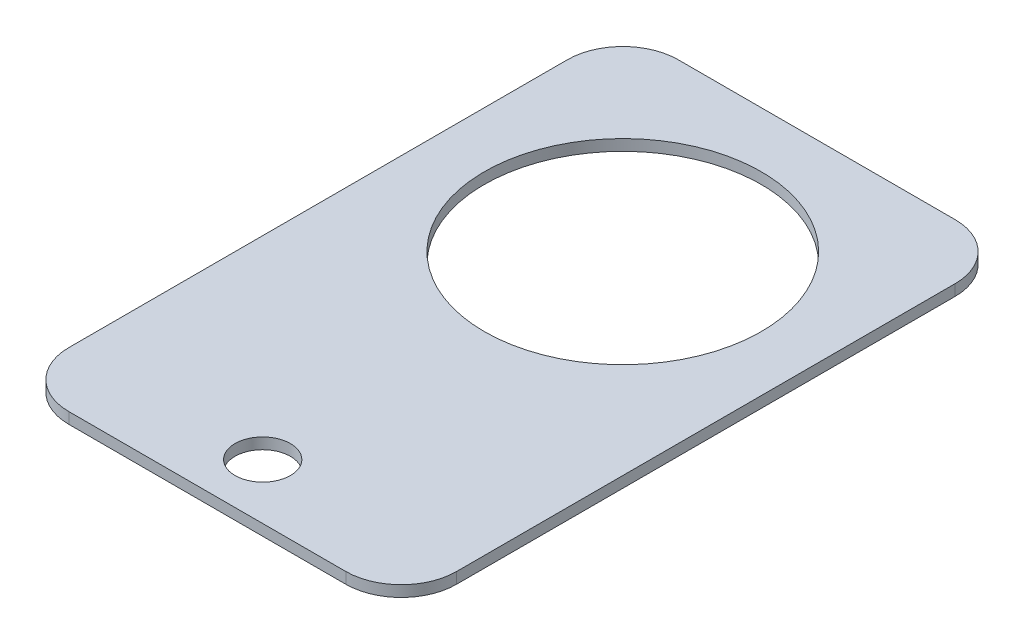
from build123d import *

# Parameters (mm, degrees)
ESQUISSE1_W             = 70
ESQUISSE1_H             = 110
BOSS_EXTRU_1_DEPTH      = 2
ESQUISSE2_R             = 25
ESQUISSE2_R_2           = 5
ENL_V_MAT_EXTRU_1_DEPTH = 131.399386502
CONG_1_R                = 10


with BuildPart() as part:
    # Esquisse1 → Boss.-Extru.1 (new body)
    with BuildSketch(Plane(origin=(0, 0, 0), x_dir=(1, 0, 0), z_dir=(0, 1, 0))):
        with Locations((35, 55)):
            Rectangle(ESQUISSE1_W, ESQUISSE1_H)
    extrude(amount=BOSS_EXTRU_1_DEPTH)

    # Esquisse2 → Enl_v. mat.-Extru.1 (cut, through all)
    with BuildSketch(Plane(origin=(0, 2, 0), x_dir=(1, 0, 0), z_dir=(0, 1, 0))):
        with Locations(Location((35, 75, 0), (0, 0, 270))):
            Circle(ESQUISSE2_R)
        with Locations(Location((35, 10, 0), (0, 0, 270))):
            Circle(ESQUISSE2_R_2)
    extrude(amount=-ENL_V_MAT_EXTRU_1_DEPTH, mode=Mode.SUBTRACT)

    # Cong_1
    cong_1_edges = [part.edges().sort_by_distance(p)[0] for p in [
        (0, 1, -110),
        (70, 1, -110),
        (70, 1, 0),
        (0, 1, 0),
    ]]
    fillet(cong_1_edges, radius=CONG_1_R)


solid = part.part
